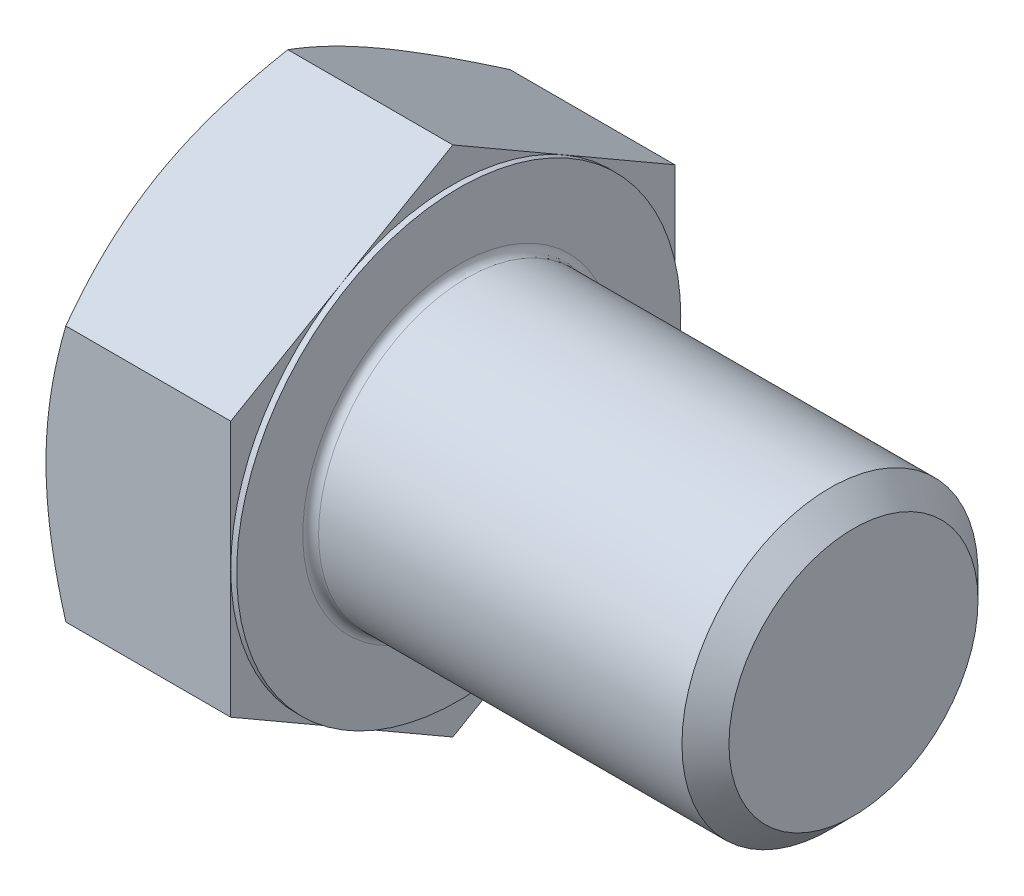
from build123d import *

# Parameters (mm, degrees)
BASEHEAD_DEPTH = 12.2682
SKETCH4_W      = 0.381
SKETCH4_H      = 27.610283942
HEADFILLET_R   = 0.508


with BuildPart() as part:
    # Sketch1 → BaseHead (new body)
    with BuildSketch(Plane(origin=(0, 0, 0), x_dir=(0, 0, -1), z_dir=(1, 0, 0))):
        Polygon((14.2875, 8.248891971), (14.2875, -8.248891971), (0, -16.497783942), (-14.2875, -8.248891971), (-14.2875, 8.248891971), (0, 16.497783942), align=None)
    extrude(amount=BASEHEAD_DEPTH)

    # BodySke → BaseBody (revolve)
    with BuildSketch(Plane.XY, mode=Mode.PRIVATE) as basebody_sk:
        Polygon((0, 0), (37.6682, 0), (37.6682, 8.01243), (36.15563, 9.525), (0, 9.525), align=None)
    revolve(basebody_sk.sketch.rotate(Axis((0, 0, 0), (1, 0, 0)), 90), axis=Axis((0, 0, 0), (1, 0, 0)))

    # Sketch3 → HeadChamfer (revolve, cut)
    with BuildSketch(Plane.XY):
        Polygon((0, 14.2875), (4.942282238, 22.847783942), (4.942282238, 29.197783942), (-12.7, 29.197783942), (-12.7, 14.2875), align=None)
    revolve(axis=Axis((0, 0, 0), (1, 0, 0)), mode=Mode.SUBTRACT)

    # Sketch4 → BearingFace (revolve, cut)
    with BuildSketch(Plane.XY, mode=Mode.PRIVATE) as bearingface_sk:
        with Locations((12.0777, 28.092641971)):
            Rectangle(SKETCH4_W, SKETCH4_H)
    revolve(bearingface_sk.sketch.rotate(Axis((0, 0, 0), (1, 0, 0)), 270), axis=Axis((0, 0, 0), (1, 0, 0)), mode=Mode.SUBTRACT)

    # HeadFillet
    headfillet_edges = [part.edges().sort_by_distance(p)[0] for p in [
        (12.2682, 0, -9.525),
    ]]
    fillet(headfillet_edges, radius=HEADFILLET_R)


solid = part.part
